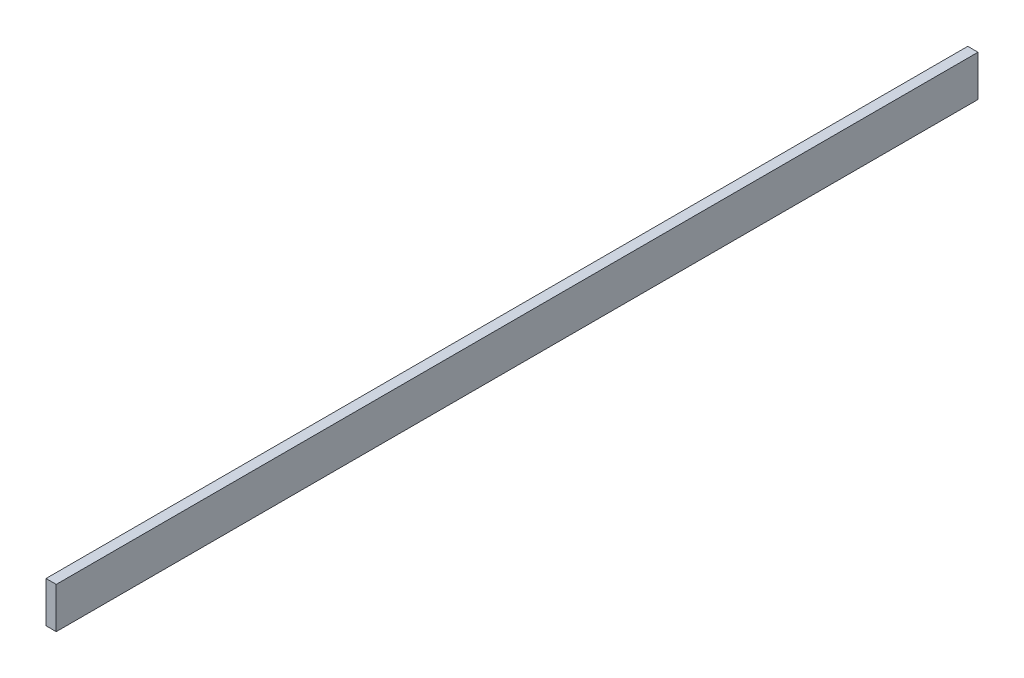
from build123d import *

# Parameters (mm, degrees)
SKETCH1_W           = 25.4
SKETCH1_H           = 101.6
BOSS_EXTRUDE1_DEPTH = 2286


with BuildPart() as part:
    # Sketch1 → Boss-Extrude1 (new body)
    with BuildSketch(Plane.XY):
        Rectangle(SKETCH1_W, SKETCH1_H)
    extrude(amount=BOSS_EXTRUDE1_DEPTH)


solid = part.part
